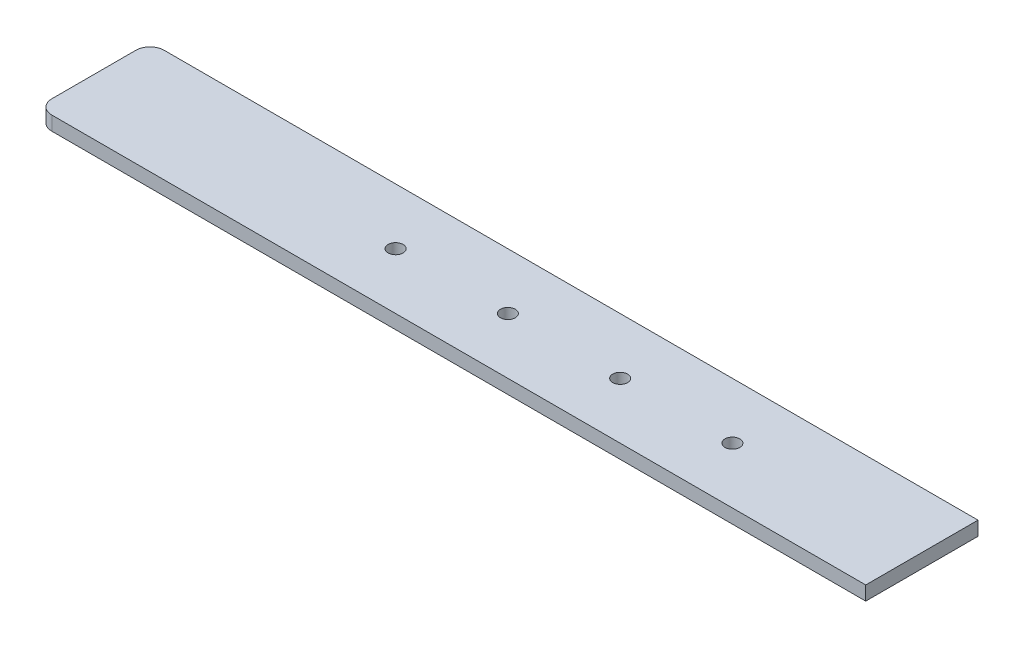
from build123d import *

# Parameters (mm, degrees)
SKETCH1_W           = 374.65
SKETCH1_H           = 50.8
BOSS_EXTRUDE1_DEPTH = 6.35
SKETCH2_R           = 3.3655
CUT_EXTRUDE1_DEPTH  = 190.145811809
FILLET1_R           = 6.35


with BuildPart() as part:
    # Sketch1 → Boss-Extrude1 (new body)
    with BuildSketch(Plane(origin=(0, 0, 0), x_dir=(1, 0, 0), z_dir=(0, 1, 0))):
        Rectangle(SKETCH1_W, SKETCH1_H)
    extrude(amount=-BOSS_EXTRUDE1_DEPTH)

    # Sketch2 → Cut-Extrude1 (cut, through all)
    with BuildSketch(Plane(origin=(0, 0, 0), x_dir=(1, 0, 0), z_dir=(0, 1, 0))):
        with Locations(Location((-50.8, 0, 0), (0, 0, 270))):
            Circle(SKETCH2_R)
        with Locations(Location((0, 0, 0), (0, 0, 270))):
            Circle(SKETCH2_R)
        with Locations(Location((50.8, 0, 0), (0, 0, 270))):
            Circle(SKETCH2_R)
        with Locations(Location((101.6, 0, 0), (0, 0, 270))):
            Circle(SKETCH2_R)
    extrude(amount=-CUT_EXTRUDE1_DEPTH, mode=Mode.SUBTRACT)

    # Fillet1
    fillet1_edges = [part.edges().sort_by_distance(p)[0] for p in [
        (-187.325, -3.175, -25.4),
        (-187.325, -3.175, 25.4),
    ]]
    fillet(fillet1_edges, radius=FILLET1_R)


solid = part.part
